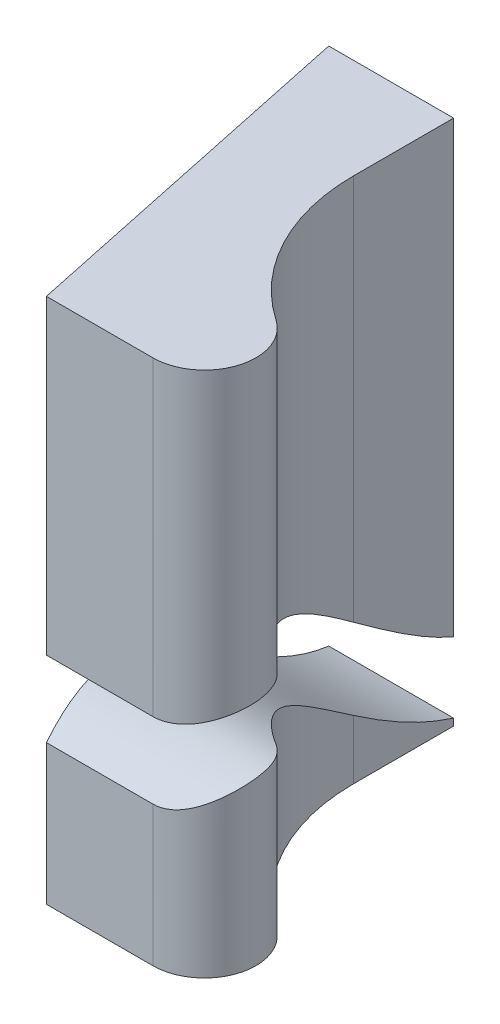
ISO-10303-21;
HEADER;
FILE_DESCRIPTION(('STEP AP214'),'2;1');
FILE_NAME('part.step','',(''),(''),'','','');
FILE_SCHEMA(('AUTOMOTIVE_DESIGN { 1 0 10303 214 1 1 1 1 }'));
ENDSEC;
DATA;
#1=APPLICATION_CONTEXT('core data for automotive mechanical design processes');
#2=APPLICATION_PROTOCOL_DEFINITION('international standard','automotive_design',2000,#1);
#3=PRODUCT_CONTEXT('',#1,'mechanical');
#4=PRODUCT('Part','Part','',(#3));
#5=PRODUCT_RELATED_PRODUCT_CATEGORY('part','',(#4));
#6=PRODUCT_DEFINITION_FORMATION('','',#4);
#7=PRODUCT_DEFINITION_CONTEXT('part definition',#1,'design');
#8=PRODUCT_DEFINITION('design','',#6,#7);
#9=PRODUCT_DEFINITION_SHAPE('','',#8);
#10=(LENGTH_UNIT() NAMED_UNIT(*) SI_UNIT(.MILLI.,.METRE.));
#11=(NAMED_UNIT(*) PLANE_ANGLE_UNIT() SI_UNIT($,.RADIAN.));
#12=(NAMED_UNIT(*) SI_UNIT($,.STERADIAN.) SOLID_ANGLE_UNIT());
#13=UNCERTAINTY_MEASURE_WITH_UNIT(LENGTH_MEASURE(1.E-05),#10,'distance_accuracy_value','');
#14=(GEOMETRIC_REPRESENTATION_CONTEXT(3) GLOBAL_UNCERTAINTY_ASSIGNED_CONTEXT((#13)) GLOBAL_UNIT_ASSIGNED_CONTEXT((#10,
#11,#12)) REPRESENTATION_CONTEXT('',''));
#15=CARTESIAN_POINT('',(0.,0.,0.));
#16=DIRECTION('',(0.,0.,1.));
#17=DIRECTION('',(1.,0.,0.));
#18=AXIS2_PLACEMENT_3D('',#15,#16,#17);
#19=CARTESIAN_POINT('',(6.68799385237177,101.6,-39.379349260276));
#20=DIRECTION('',(0.,0.,1.));
#21=DIRECTION('',(1.,0.,0.));
#22=AXIS2_PLACEMENT_3D('',#19,#20,#21);
#23=PLANE('',#22);
#24=DIRECTION('',(0.,-1.,0.));
#25=VECTOR('',#24,1.);
#26=CARTESIAN_POINT('',(-17.4066623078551,101.6,-39.379349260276));
#27=LINE('',#26,#25);
#28=CARTESIAN_POINT('',(-17.4066623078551,1.32705179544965,-39.379349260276));
#29=VERTEX_POINT('',#28);
#30=CARTESIAN_POINT('',(-17.4066623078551,0.,-39.379349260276));
#31=VERTEX_POINT('',#30);
#32=EDGE_CURVE('E114',#29,#31,#27,.T.);
#33=ORIENTED_EDGE('',*,*,#32,.F.);
#34=DIRECTION('',(1.,0.,0.));
#35=VECTOR('',#34,1.);
#36=CARTESIAN_POINT('',(4.59182488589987,1.32705179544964,-39.379349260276));
#37=LINE('',#36,#35);
#38=CARTESIAN_POINT('',(6.68799385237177,1.32705179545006,-39.3793492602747));
#39=VERTEX_POINT('',#38);
#40=EDGE_CURVE('E71',#29,#39,#37,.T.);
#41=ORIENTED_EDGE('',*,*,#40,.T.);
#42=DIRECTION('',(0.,-1.,0.));
#43=VECTOR('',#42,1.);
#44=CARTESIAN_POINT('',(6.68799385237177,101.6,-39.379349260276));
#45=LINE('',#44,#43);
#46=CARTESIAN_POINT('',(6.68799385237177,0.,-39.379349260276));
#47=VERTEX_POINT('',#46);
#48=EDGE_CURVE('E133',#39,#47,#45,.T.);
#49=ORIENTED_EDGE('',*,*,#48,.T.);
#50=DIRECTION('',(-1.,0.,0.));
#51=VECTOR('',#50,1.);
#52=CARTESIAN_POINT('',(6.68799385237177,0.,-39.379349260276));
#53=LINE('',#52,#51);
#54=EDGE_CURVE('E127',#47,#31,#53,.T.);
#55=ORIENTED_EDGE('',*,*,#54,.T.);
#56=EDGE_LOOP('',(#33,#41,#49,#55));
#57=FACE_BOUND('',#56,.T.);
#58=ADVANCED_FACE('F50',(#57),#23,.F.);
#59=CARTESIAN_POINT('',(-17.4066623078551,101.6,-39.379349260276));
#60=DIRECTION('',(0.97840332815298,0.,-0.206704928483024));
#61=DIRECTION('',(-0.206704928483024,0.,-0.97840332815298));
#62=AXIS2_PLACEMENT_3D('',#59,#60,#61);
#63=PLANE('',#62);
#64=DIRECTION('',(0.,-1.,0.));
#65=VECTOR('',#64,1.);
#66=CARTESIAN_POINT('',(-2.81317454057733,101.6,29.6964928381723));
#67=LINE('',#66,#65);
#68=CARTESIAN_POINT('',(-2.81317454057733,27.0247550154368,29.6964928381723));
#69=VERTEX_POINT('',#68);
#70=CARTESIAN_POINT('',(-2.81317454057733,0.,29.6964928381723));
#71=VERTEX_POINT('',#70);
#72=EDGE_CURVE('E109',#69,#71,#67,.T.);
#73=ORIENTED_EDGE('',*,*,#72,.F.);
#74=CARTESIAN_POINT('',(-2.81317454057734,27.0247550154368,29.6964928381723));
#75=CARTESIAN_POINT('',(-2.86577040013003,27.2133397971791,29.4475391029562));
#76=CARTESIAN_POINT('',(-2.91901082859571,27.3977581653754,29.1955344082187));
#77=CARTESIAN_POINT('',(-3.02687731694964,27.7578038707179,28.6849663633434));
#78=CARTESIAN_POINT('',(-3.08150554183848,27.9334160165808,28.4263927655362));
#79=CARTESIAN_POINT('',(-3.19211366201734,28.2748955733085,27.9028476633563));
#80=CARTESIAN_POINT('',(-3.24809462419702,28.4407549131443,27.6378711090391));
#81=CARTESIAN_POINT('',(-3.36136592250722,28.7618027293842,27.1017202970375));
#82=CARTESIAN_POINT('',(-3.41865651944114,28.9169890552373,26.8305448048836));
#83=CARTESIAN_POINT('',(-3.53462796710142,29.2161457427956,26.2816132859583));
#84=CARTESIAN_POINT('',(-3.59331141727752,29.3600925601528,26.0038449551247));
#85=CARTESIAN_POINT('',(-3.71188550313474,29.6355508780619,25.4425942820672));
#86=CARTESIAN_POINT('',(-3.77177565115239,29.7670672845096,25.159114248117));
#87=CARTESIAN_POINT('',(-3.89269970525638,30.0169103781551,24.5867403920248));
#88=CARTESIAN_POINT('',(-3.95373323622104,30.1352413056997,24.2978483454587));
#89=CARTESIAN_POINT('',(-4.07686955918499,30.35804083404,23.7150030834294));
#90=CARTESIAN_POINT('',(-4.13897232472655,30.4625097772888,23.4210499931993));
#91=CARTESIAN_POINT('',(-4.28585107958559,30.6906847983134,22.7258238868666));
#92=CARTESIAN_POINT('',(-4.37102199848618,30.8085003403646,22.3226815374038));
#93=CARTESIAN_POINT('',(-4.54280534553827,31.0166932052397,21.5095736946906));
#94=CARTESIAN_POINT('',(-4.6294181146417,31.1070639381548,21.099606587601));
#95=CARTESIAN_POINT('',(-4.80368942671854,31.2596779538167,20.2747223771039));
#96=CARTESIAN_POINT('',(-4.8913478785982,31.3219236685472,19.8598057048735));
#97=CARTESIAN_POINT('',(-5.06699950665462,31.4180500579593,19.0283879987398));
#98=CARTESIAN_POINT('',(-5.15499028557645,31.4520336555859,18.6118983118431));
#99=CARTESIAN_POINT('',(-5.33124373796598,31.4925266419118,17.7776319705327));
#100=CARTESIAN_POINT('',(-5.41950642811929,31.4990343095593,17.3598552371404));
#101=CARTESIAN_POINT('',(-5.59593939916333,31.4855967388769,16.5247391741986));
#102=CARTESIAN_POINT('',(-5.68410967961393,31.4656513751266,16.1073998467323));
#103=CARTESIAN_POINT('',(-5.87355613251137,31.3957532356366,15.2106866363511));
#104=CARTESIAN_POINT('',(-5.97476704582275,31.3416650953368,14.7316216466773));
#105=CARTESIAN_POINT('',(-6.17629545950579,31.2028406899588,13.7777204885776));
#106=CARTESIAN_POINT('',(-6.27661275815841,31.1180976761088,13.3028852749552));
#107=CARTESIAN_POINT('',(-6.4760748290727,30.9208789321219,12.3587648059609));
#108=CARTESIAN_POINT('',(-6.57521949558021,30.8084007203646,11.8894800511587));
#109=CARTESIAN_POINT('',(-6.77260954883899,30.5581030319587,10.9551671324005));
#110=CARTESIAN_POINT('',(-6.87084870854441,30.4201694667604,10.4901684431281));
#111=CARTESIAN_POINT('',(-7.06585574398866,30.1222306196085,9.56713514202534));
#112=CARTESIAN_POINT('',(-7.162623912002,29.9622297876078,9.10909914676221));
#113=CARTESIAN_POINT('',(-7.35466498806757,29.6228661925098,8.20010472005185));
#114=CARTESIAN_POINT('',(-7.4499382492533,29.4435080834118,7.74914461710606));
#115=CARTESIAN_POINT('',(-7.63504118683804,29.0757858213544,6.87299071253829));
#116=CARTESIAN_POINT('',(-7.72493069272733,28.8881232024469,6.44751371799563));
#117=CARTESIAN_POINT('',(-7.90344503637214,28.4991597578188,5.60254582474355));
#118=CARTESIAN_POINT('',(-7.99206976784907,28.2978577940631,5.18305542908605));
#119=CARTESIAN_POINT('',(-8.16818669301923,27.8831876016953,4.34943531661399));
#120=CARTESIAN_POINT('',(-8.25567794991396,27.6698100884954,3.93531003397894));
#121=CARTESIAN_POINT('',(-8.4295456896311,27.2326489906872,3.11233606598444));
#122=CARTESIAN_POINT('',(-8.51592211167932,27.008864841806,2.70348766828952));
#123=CARTESIAN_POINT('',(-8.68780040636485,26.5518473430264,1.88993040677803));
#124=CARTESIAN_POINT('',(-8.77330042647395,26.318597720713,1.48523031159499));
#125=CARTESIAN_POINT('',(-8.94336358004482,25.8442256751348,0.680264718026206));
#126=CARTESIAN_POINT('',(-9.02792668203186,25.6031029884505,0.279999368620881));
#127=CARTESIAN_POINT('',(-9.2805653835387,24.8689535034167,-0.915823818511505));
#128=CARTESIAN_POINT('',(-9.44737501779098,24.3657247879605,-1.70538942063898));
#129=CARTESIAN_POINT('',(-9.77832512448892,23.3395542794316,-3.27188659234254));
#130=CARTESIAN_POINT('',(-9.94246599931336,22.8166154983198,-4.04882006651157));
#131=CARTESIAN_POINT('',(-10.2699464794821,21.753186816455,-5.59889433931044));
#132=CARTESIAN_POINT('',(-10.4332726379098,21.2126003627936,-6.37197148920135));
#133=CARTESIAN_POINT('',(-10.758392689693,20.1232699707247,-7.9108730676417));
#134=CARTESIAN_POINT('',(-10.9201885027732,19.5745393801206,-8.67670658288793));
#135=CARTESIAN_POINT('',(-11.2429955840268,18.4729530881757,-10.204660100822));
#136=CARTESIAN_POINT('',(-11.4040073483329,17.9201007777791,-10.9667824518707));
#137=CARTESIAN_POINT('',(-11.7259327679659,16.8138968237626,-12.4905627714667));
#138=CARTESIAN_POINT('',(-11.8868464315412,16.2605452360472,-13.2522207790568));
#139=CARTESIAN_POINT('',(-12.2092270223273,15.1567254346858,-14.7781555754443));
#140=CARTESIAN_POINT('',(-12.3706941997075,14.6062589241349,-15.542433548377));
#141=CARTESIAN_POINT('',(-12.659136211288,13.6320124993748,-16.9077257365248));
#142=CARTESIAN_POINT('',(-12.7859180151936,13.2068977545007,-17.5078262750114));
#143=CARTESIAN_POINT('',(-13.0403744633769,12.3624345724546,-18.7122534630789));
#144=CARTESIAN_POINT('',(-13.1680494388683,11.9430884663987,-19.3165816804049));
#145=CARTESIAN_POINT('',(-13.4244653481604,11.1121800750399,-20.5302836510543));
#146=CARTESIAN_POINT('',(-13.5532062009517,10.7006172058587,-21.139657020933));
#147=CARTESIAN_POINT('',(-13.8119309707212,9.88732216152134,-22.3642875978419));
#148=CARTESIAN_POINT('',(-13.9419143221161,9.48558578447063,-22.979542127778));
#149=CARTESIAN_POINT('',(-14.2033076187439,8.69403789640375,-24.2168037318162));
#150=CARTESIAN_POINT('',(-14.3347165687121,8.30421871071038,-24.8388060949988));
#151=CARTESIAN_POINT('',(-14.5991535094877,7.53866547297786,-26.090474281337));
#152=CARTESIAN_POINT('',(-14.7321802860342,7.16292162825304,-26.7201343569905));
#153=CARTESIAN_POINT('',(-15.0003728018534,6.42689955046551,-27.9895789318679));
#154=CARTESIAN_POINT('',(-15.1355419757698,6.06665053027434,-28.6293796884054));
#155=CARTESIAN_POINT('',(-15.4079385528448,5.36492059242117,-29.9187234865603));
#156=CARTESIAN_POINT('',(-15.5451657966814,5.02343823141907,-30.5682657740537));
#157=CARTESIAN_POINT('',(-15.8219079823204,4.36178140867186,-31.8781787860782));
#158=CARTESIAN_POINT('',(-15.9614242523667,4.04161990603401,-32.5385557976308));
#159=CARTESIAN_POINT('',(-16.2429889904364,3.42532273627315,-33.8712955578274));
#160=CARTESIAN_POINT('',(-16.3850412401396,3.12922738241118,-34.5436762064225));
#161=CARTESIAN_POINT('',(-16.6719487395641,2.56398368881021,-35.9017050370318));
#162=CARTESIAN_POINT('',(-16.8168113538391,2.2949223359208,-36.5873880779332));
#163=CARTESIAN_POINT('',(-17.1096114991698,1.78694056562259,-37.973308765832));
#164=CARTESIAN_POINT('',(-17.2575609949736,1.54818190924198,-38.6736030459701));
#165=CARTESIAN_POINT('',(-17.4066623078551,1.32705179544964,-39.379349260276));
#166=B_SPLINE_CURVE_WITH_KNOTS('',3,(#74,#75,#76,#77,#78,#79,#80,#81,#82,#83,#84,#85,#86,#87,
#88,#89,#90,#91,#92,#93,#94,#95,#96,#97,#98,#99,#100,#101,#102,#103,#104,#105,#106,#107,#108,
#109,#110,#111,#112,#113,#114,#115,#116,#117,#118,#119,#120,#121,#122,#123,#124,#125,#126,#127,
#128,#129,#130,#131,#132,#133,#134,#135,#136,#137,#138,#139,#140,#141,#142,#143,#144,#145,#146,
#147,#148,#149,#150,#151,#152,#153,#154,#155,#156,#157,#158,#159,#160,#161,#162,#163,#164,#165),
.UNSPECIFIED.,.F.,.F.,(4,2,2,2,2,2,2,2,2,2,2,2,2,2,2,2,2,2,2,2,2,2,2,2,2,2,2,2,2,2,2,2,2,2,2,2,
2,2,2,2,2,2,2,2,2,4),(0.,0.95013908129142,1.90186448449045,2.85436672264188,3.8070603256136,
4.76169886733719,5.71595905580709,6.66991147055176,7.62384031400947,8.90854631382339,
10.193560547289,11.4784636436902,12.7586667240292,14.0389499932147,15.3192393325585,
16.7960093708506,18.2731047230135,19.750332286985,21.2343489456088,22.7180667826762,
24.2014286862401,25.6220655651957,27.0428211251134,28.4646843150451,29.8866246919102,
31.3111227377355,32.7356684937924,35.5883345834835,38.4405665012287,41.3125748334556,
44.1803059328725,47.045892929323,49.9111912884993,52.7780243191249,55.0168052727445,
57.2564658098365,59.4959576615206,61.7344745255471,63.9715180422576,66.2069751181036,
68.4464769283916,70.6858062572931,72.9264844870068,75.1708418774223,77.4222039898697,
79.6851195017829),.UNSPECIFIED.);
#167=EDGE_CURVE('E119',#69,#29,#166,.T.);
#168=ORIENTED_EDGE('',*,*,#167,.T.);
#169=ORIENTED_EDGE('',*,*,#32,.T.);
#170=DIRECTION('',(0.206704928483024,0.,0.97840332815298));
#171=VECTOR('',#170,1.);
#172=CARTESIAN_POINT('',(-17.4066623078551,0.,-39.379349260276));
#173=LINE('',#172,#171);
#174=EDGE_CURVE('E117',#31,#71,#173,.T.);
#175=ORIENTED_EDGE('',*,*,#174,.T.);
#176=EDGE_LOOP('',(#73,#168,#169,#175));
#177=FACE_BOUND('',#176,.T.);
#178=ADVANCED_FACE('F116',(#177),#63,.F.);
#179=CARTESIAN_POINT('',(-2.81317454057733,101.6,29.6964928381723));
#180=DIRECTION('',(0.,0.,-1.));
#181=DIRECTION('',(-1.,0.,0.));
#182=AXIS2_PLACEMENT_3D('',#179,#180,#181);
#183=PLANE('',#182);
#184=DIRECTION('',(0.,-1.,0.));
#185=VECTOR('',#184,1.);
#186=CARTESIAN_POINT('',(17.7258082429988,101.6,29.6964928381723));
#187=LINE('',#186,#185);
#188=CARTESIAN_POINT('',(17.7258082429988,27.0247550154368,29.6964928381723));
#189=VERTEX_POINT('',#188);
#190=CARTESIAN_POINT('',(17.7258082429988,0.,29.6964928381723));
#191=VERTEX_POINT('',#190);
#192=EDGE_CURVE('E218',#189,#191,#187,.T.);
#193=ORIENTED_EDGE('',*,*,#192,.F.);
#194=DIRECTION('',(1.,0.,0.));
#195=VECTOR('',#194,1.);
#196=CARTESIAN_POINT('',(4.59182488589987,27.0247550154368,29.6964928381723));
#197=LINE('',#196,#195);
#198=EDGE_CURVE('E130',#189,#69,#197,.F.);
#199=ORIENTED_EDGE('',*,*,#198,.T.);
#200=ORIENTED_EDGE('',*,*,#72,.T.);
#201=DIRECTION('',(1.,0.,0.));
#202=VECTOR('',#201,1.);
#203=CARTESIAN_POINT('',(-2.81317454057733,0.,29.6964928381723));
#204=LINE('',#203,#202);
#205=EDGE_CURVE('E129',#71,#191,#204,.T.);
#206=ORIENTED_EDGE('',*,*,#205,.T.);
#207=EDGE_LOOP('',(#193,#199,#200,#206));
#208=FACE_BOUND('',#207,.T.);
#209=ADVANCED_FACE('F147',(#208),#183,.F.);
#210=CARTESIAN_POINT('',(17.7258082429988,101.6,19.7461535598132));
#211=DIRECTION('',(0.,-1.,0.));
#212=DIRECTION('',(0.,0.,-1.));
#213=AXIS2_PLACEMENT_3D('',#210,#211,#212);
#214=CYLINDRICAL_SURFACE('',#213,9.95033927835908);
#215=DIRECTION('',(0.,-1.,0.));
#216=VECTOR('',#215,1.);
#217=CARTESIAN_POINT('',(23.3470035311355,101.6,11.5357080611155));
#218=LINE('',#217,#216);
#219=CARTESIAN_POINT('',(23.3470035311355,30.7133704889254,11.5357080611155));
#220=VERTEX_POINT('',#219);
#221=CARTESIAN_POINT('',(23.3470035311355,0.,11.5357080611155));
#222=VERTEX_POINT('',#221);
#223=EDGE_CURVE('E224',#220,#222,#218,.T.);
#224=ORIENTED_EDGE('',*,*,#223,.F.);
#225=CARTESIAN_POINT('',(23.3470035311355,30.7133704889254,11.5357080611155));
#226=CARTESIAN_POINT('',(23.5765390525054,30.7547322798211,11.6928392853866));
#227=CARTESIAN_POINT('',(23.7993347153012,30.7971264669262,11.8595273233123));
#228=CARTESIAN_POINT('',(24.2301638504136,30.8824133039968,12.21091579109));
#229=CARTESIAN_POINT('',(24.43819626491,30.9253059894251,12.3956175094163));
#230=CARTESIAN_POINT('',(24.8387375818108,31.0101345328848,12.7824446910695));
#231=CARTESIAN_POINT('',(25.0312018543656,31.0520674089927,12.9846170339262));
#232=CARTESIAN_POINT('',(25.398713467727,31.1331717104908,13.4047296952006));
#233=CARTESIAN_POINT('',(25.5737613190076,31.1723432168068,13.6226695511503));
#234=CARTESIAN_POINT('',(25.9054902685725,31.2462644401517,14.0733703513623));
#235=CARTESIAN_POINT('',(26.062141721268,31.281007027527,14.3061543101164));
#236=CARTESIAN_POINT('',(26.3555475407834,31.3442528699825,14.7847403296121));
#237=CARTESIAN_POINT('',(26.4923033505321,31.3727565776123,15.0305414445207));
#238=CARTESIAN_POINT('',(26.7446029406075,31.4217923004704,15.5331334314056));
#239=CARTESIAN_POINT('',(26.8601769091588,31.4423357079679,15.7899080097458));
#240=CARTESIAN_POINT('',(27.0693036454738,31.4739268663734,16.3128425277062));
#241=CARTESIAN_POINT('',(27.1628579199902,31.4849752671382,16.5790018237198));
#242=CARTESIAN_POINT('',(27.3231037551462,31.4959320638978,17.1054747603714));
#243=CARTESIAN_POINT('',(27.3908751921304,31.4963531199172,17.3654490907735));
#244=CARTESIAN_POINT('',(27.5051401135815,31.4864211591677,17.8898353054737));
#245=CARTESIAN_POINT('',(27.5516343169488,31.4760685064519,18.1542470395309));
#246=CARTESIAN_POINT('',(27.6230562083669,31.4439791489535,18.6852582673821));
#247=CARTESIAN_POINT('',(27.6479859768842,31.4222435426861,18.9518575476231));
#248=CARTESIAN_POINT('',(27.676300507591,31.3671488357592,19.4849903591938));
#249=CARTESIAN_POINT('',(27.6796861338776,31.3337902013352,19.7515238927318));
#250=CARTESIAN_POINT('',(27.6657405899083,31.2583164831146,20.2639055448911));
#251=CARTESIAN_POINT('',(27.6498284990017,31.2169682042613,20.5099074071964));
#252=CARTESIAN_POINT('',(27.6001029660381,31.1247552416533,20.9982695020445));
#253=CARTESIAN_POINT('',(27.5662905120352,31.0738910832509,21.2406299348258));
#254=CARTESIAN_POINT('',(27.4813976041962,30.9632987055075,21.7202480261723));
#255=CARTESIAN_POINT('',(27.430316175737,30.9035699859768,21.9575053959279));
#256=CARTESIAN_POINT('',(27.3116266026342,30.7761025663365,22.4256419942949));
#257=CARTESIAN_POINT('',(27.2440176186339,30.7083634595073,22.6565208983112));
#258=CARTESIAN_POINT('',(27.0893976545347,30.5624152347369,23.1218674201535));
#259=CARTESIAN_POINT('',(27.0016042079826,30.4838575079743,23.3559652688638));
#260=CARTESIAN_POINT('',(26.8095855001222,30.3202711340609,23.8150838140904));
#261=CARTESIAN_POINT('',(26.7053532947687,30.2352397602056,24.0401006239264));
#262=CARTESIAN_POINT('',(26.4812978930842,30.0600480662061,24.48024898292));
#263=CARTESIAN_POINT('',(26.3614692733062,29.9698859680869,24.6953770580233));
#264=CARTESIAN_POINT('',(26.1070115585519,29.7858450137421,25.1150371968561));
#265=CARTESIAN_POINT('',(25.9723810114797,29.6919657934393,25.3195682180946));
#266=CARTESIAN_POINT('',(25.668401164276,29.4881053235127,25.746380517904));
#267=CARTESIAN_POINT('',(25.4968492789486,29.3777657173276,25.9669255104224));
#268=CARTESIAN_POINT('',(25.1360485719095,29.1562505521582,26.3926153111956));
#269=CARTESIAN_POINT('',(24.9467975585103,29.0450748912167,26.5977582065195));
#270=CARTESIAN_POINT('',(24.5512124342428,28.8240837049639,26.9919187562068));
#271=CARTESIAN_POINT('',(24.3448691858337,28.7142689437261,27.1809276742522));
#272=CARTESIAN_POINT('',(23.9158369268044,28.4984110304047,27.5417514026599));
#273=CARTESIAN_POINT('',(23.693149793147,28.3923674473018,27.7135681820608));
#274=CARTESIAN_POINT('',(23.2541153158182,28.196344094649,28.0233625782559));
#275=CARTESIAN_POINT('',(23.0391954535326,28.1057976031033,28.1630048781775));
#276=CARTESIAN_POINT('',(22.5971144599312,27.931710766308,28.4263495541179));
#277=CARTESIAN_POINT('',(22.3699553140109,27.8481692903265,28.5500545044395));
#278=CARTESIAN_POINT('',(21.904775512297,27.6902689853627,28.7801241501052));
#279=CARTESIAN_POINT('',(21.6667862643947,27.6158856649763,28.8865353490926));
#280=CARTESIAN_POINT('',(21.1804279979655,27.4780168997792,29.0812187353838));
#281=CARTESIAN_POINT('',(20.9320596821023,27.4145307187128,29.1694921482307));
#282=CARTESIAN_POINT('',(20.4451176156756,27.3045901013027,29.3208443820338));
#283=CARTESIAN_POINT('',(20.2071807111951,27.2572225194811,29.3853049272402));
#284=CARTESIAN_POINT('',(19.725182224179,27.1748274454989,29.4966880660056));
#285=CARTESIAN_POINT('',(19.4811220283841,27.1397971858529,29.5436145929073));
#286=CARTESIAN_POINT('',(18.986458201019,27.0829164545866,29.6195078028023));
#287=CARTESIAN_POINT('',(18.7358162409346,27.0611825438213,29.6483157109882));
#288=CARTESIAN_POINT('',(18.3580945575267,27.0393677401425,29.6771888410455));
#289=CARTESIAN_POINT('',(18.2318192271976,27.0338937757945,29.6844234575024));
#290=CARTESIAN_POINT('',(17.9789719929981,27.0265857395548,29.6940763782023));
#291=CARTESIAN_POINT('',(17.8524000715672,27.0247518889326,29.6964943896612));
#292=CARTESIAN_POINT('',(17.7258082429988,27.0247550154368,29.6964928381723));
#293=B_SPLINE_CURVE_WITH_KNOTS('',3,(#225,#226,#227,#228,#229,#230,#231,#232,#233,#234,#235,
#236,#237,#238,#239,#240,#241,#242,#243,#244,#245,#246,#247,#248,#249,#250,#251,#252,#253,#254,
#255,#256,#257,#258,#259,#260,#261,#262,#263,#264,#265,#266,#267,#268,#269,#270,#271,#272,#273,
#274,#275,#276,#277,#278,#279,#280,#281,#282,#283,#284,#285,#286,#287,#288,#289,#290,#291,#292),
.UNSPECIFIED.,.F.,.F.,(4,2,2,2,2,2,2,2,2,2,2,2,2,2,2,2,2,2,2,2,2,2,2,2,2,2,2,2,2,2,2,2,2,4),(0.,
0.843420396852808,1.68690116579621,2.53272007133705,3.37851417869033,4.22565309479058,
5.07273054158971,5.91859118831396,6.76439393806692,7.56931313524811,8.37420513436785,
9.17901947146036,9.98380152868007,10.732825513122,11.4818081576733,12.230833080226,
12.9798960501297,13.7653179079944,14.5510724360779,15.337100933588,16.1232066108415,
17.0234829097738,17.9238708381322,18.824743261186,19.725512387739,20.540209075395,
21.3547740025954,22.1671109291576,22.9793929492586,23.7315185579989,24.4834753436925,
25.2419329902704,25.6216098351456,26.0013097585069),.UNSPECIFIED.);
#294=EDGE_CURVE('E87',#220,#189,#293,.T.);
#295=ORIENTED_EDGE('',*,*,#294,.T.);
#296=ORIENTED_EDGE('',*,*,#192,.T.);
#297=CARTESIAN_POINT('',(17.7258082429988,0.,19.7461535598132));
#298=DIRECTION('',(0.,1.,0.));
#299=DIRECTION('',(0.,0.,1.));
#300=AXIS2_PLACEMENT_3D('',#297,#298,#299);
#301=CIRCLE('',#300,9.95033927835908);
#302=EDGE_CURVE('E223',#191,#222,#301,.T.);
#303=ORIENTED_EDGE('',*,*,#302,.T.);
#304=EDGE_LOOP('',(#224,#295,#296,#303));
#305=FACE_BOUND('',#304,.T.);
#306=ADVANCED_FACE('F165',(#305),#214,.T.);
#307=CARTESIAN_POINT('',(44.9779649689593,101.6,-20.0589654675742));
#308=DIRECTION('',(0.,-1.,0.));
#309=DIRECTION('',(0.,0.,-1.));
#310=AXIS2_PLACEMENT_3D('',#307,#308,#309);
#311=CYLINDRICAL_SURFACE('',#310,38.2899711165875);
#312=DIRECTION('',(0.,-1.,0.));
#313=VECTOR('',#312,1.);
#314=CARTESIAN_POINT('',(6.68799385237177,101.6,-20.0589654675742));
#315=LINE('',#314,#313);
#316=CARTESIAN_POINT('',(6.68799385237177,11.4349415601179,-20.0589654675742));
#317=VERTEX_POINT('',#316);
#318=CARTESIAN_POINT('',(6.68799385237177,0.,-20.0589654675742));
#319=VERTEX_POINT('',#318);
#320=EDGE_CURVE('E63',#317,#319,#315,.T.);
#321=ORIENTED_EDGE('',*,*,#320,.F.);
#322=CARTESIAN_POINT('',(6.68799385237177,11.4349415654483,-20.0589654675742));
#323=CARTESIAN_POINT('',(6.68799724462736,11.6618463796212,-19.7268533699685));
#324=CARTESIAN_POINT('',(6.69231444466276,11.8899067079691,-19.3955511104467));
#325=CARTESIAN_POINT('',(6.70947825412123,12.3479507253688,-18.7345106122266));
#326=CARTESIAN_POINT('',(6.72232467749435,12.5779343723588,-18.4047723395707));
#327=CARTESIAN_POINT('',(6.77356075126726,13.2708797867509,-17.4168345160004));
#328=CARTESIAN_POINT('',(6.82464665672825,13.736169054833,-16.7608845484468));
#329=CARTESIAN_POINT('',(6.96023220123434,14.6702383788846,-15.4539754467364));
#330=CARTESIAN_POINT('',(7.04476597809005,15.1390215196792,-14.8030221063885));
#331=CARTESIAN_POINT('',(7.24719065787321,16.0767503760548,-13.5059843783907));
#332=CARTESIAN_POINT('',(7.36509637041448,16.5456960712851,-12.859902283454));
#333=CARTESIAN_POINT('',(7.63713846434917,17.489537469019,-11.5598979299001));
#334=CARTESIAN_POINT('',(7.79193679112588,17.9643707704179,-10.9060686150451));
#335=CARTESIAN_POINT('',(8.13704750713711,18.9071514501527,-9.60321953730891));
#336=CARTESIAN_POINT('',(8.32734569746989,19.3751015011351,-8.95419795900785));
#337=CARTESIAN_POINT('',(8.74438808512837,20.3004729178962,-7.66093519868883));
#338=CARTESIAN_POINT('',(8.97111166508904,20.7579000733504,-7.01669152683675));
#339=CARTESIAN_POINT('',(9.46232774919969,21.6585700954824,-5.7329931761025));
#340=CARTESIAN_POINT('',(9.72680600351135,22.1018182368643,-5.09353678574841));
#341=CARTESIAN_POINT('',(10.1847413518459,22.8015651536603,-4.0672390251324));
#342=CARTESIAN_POINT('',(10.365889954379,23.0637368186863,-3.67873846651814));
#343=CARTESIAN_POINT('',(10.7432878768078,23.5803430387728,-2.90395314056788));
#344=CARTESIAN_POINT('',(10.9395361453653,23.8347781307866,-2.51766822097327));
#345=CARTESIAN_POINT('',(11.3475054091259,24.334910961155,-1.7476603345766));
#346=CARTESIAN_POINT('',(11.5592252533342,24.5806093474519,-1.36393717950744));
#347=CARTESIAN_POINT('',(11.9985430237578,25.062305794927,-0.599417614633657));
#348=CARTESIAN_POINT('',(12.2261426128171,25.2983028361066,-0.218621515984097));
#349=CARTESIAN_POINT('',(12.6953371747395,25.7574070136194,0.535921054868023));
#350=CARTESIAN_POINT('',(12.9367820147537,25.9806137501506,0.909700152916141));
#351=CARTESIAN_POINT('',(13.4358551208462,26.4155385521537,1.65318929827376));
#352=CARTESIAN_POINT('',(13.6934847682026,26.6272556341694,2.02289899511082));
#353=CARTESIAN_POINT('',(14.2250714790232,27.0382356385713,2.75740854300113));
#354=CARTESIAN_POINT('',(14.4990267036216,27.2374999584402,3.12220894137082));
#355=CARTESIAN_POINT('',(15.0633597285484,27.6227376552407,3.84603065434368));
#356=CARTESIAN_POINT('',(15.3537358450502,27.8087123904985,4.2050525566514));
#357=CARTESIAN_POINT('',(15.9199881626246,28.1481290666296,4.87954255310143));
#358=CARTESIAN_POINT('',(16.1942536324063,28.302945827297,5.19567193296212));
#359=CARTESIAN_POINT('',(16.7558713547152,28.6009057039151,5.82176409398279));
#360=CARTESIAN_POINT('',(17.0432237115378,28.7440487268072,6.1317268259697));
#361=CARTESIAN_POINT('',(17.6307929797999,29.0183424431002,6.74465910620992));
#362=CARTESIAN_POINT('',(17.9310092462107,29.1494937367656,7.04762900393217));
#363=CARTESIAN_POINT('',(18.5440139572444,29.3996358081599,7.64575428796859));
#364=CARTESIAN_POINT('',(18.8568020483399,29.5186269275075,7.94090989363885));
#365=CARTESIAN_POINT('',(19.4994578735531,29.7461572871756,8.52703771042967));
#366=CARTESIAN_POINT('',(19.8295138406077,29.8545085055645,8.81787658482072));
#367=CARTESIAN_POINT('',(20.5017393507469,30.0588048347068,9.3898215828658));
#368=CARTESIAN_POINT('',(20.8439101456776,30.1547486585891,9.67092669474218));
#369=CARTESIAN_POINT('',(21.5398604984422,30.3345382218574,10.2226180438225));
#370=CARTESIAN_POINT('',(21.893642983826,30.4183808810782,10.4932015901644));
#371=CARTESIAN_POINT('',(22.6122360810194,30.5744652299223,11.0231146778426));
#372=CARTESIAN_POINT('',(22.9770506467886,30.6467027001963,11.2824401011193));
#373=CARTESIAN_POINT('',(23.3470035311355,30.7133704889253,11.5357080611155));
#374=B_SPLINE_CURVE_WITH_KNOTS('',3,(#322,#323,#324,#325,#326,#327,#328,#329,#330,#331,#332,
#333,#334,#335,#336,#337,#338,#339,#340,#341,#342,#343,#344,#345,#346,#347,#348,#349,#350,#351,
#352,#353,#354,#355,#356,#357,#358,#359,#360,#361,#362,#363,#364,#365,#366,#367,#368,#369,#370,
#371,#372,#373),.UNSPECIFIED.,.F.,.F.,(4,2,2,2,2,2,2,2,2,2,2,2,2,2,2,2,2,2,2,2,2,2,2,2,2,4),(0.,
1.2066157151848,2.41320511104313,4.82991878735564,7.24910541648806,9.66936730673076,
12.1368458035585,14.6033394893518,17.0684419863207,19.532616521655,21.0397907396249,
22.5468601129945,24.05381748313,25.5609328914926,27.054008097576,28.5472109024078,
30.0402458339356,31.5331279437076,32.8714675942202,34.2098179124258,35.5481012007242,
36.8863468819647,38.245091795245,39.6039775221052,40.9632085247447,42.3229325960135),.UNSPECIFIED.);
#375=EDGE_CURVE('E90',#317,#220,#374,.T.);
#376=ORIENTED_EDGE('',*,*,#375,.T.);
#377=ORIENTED_EDGE('',*,*,#223,.T.);
#378=CARTESIAN_POINT('',(44.9779649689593,0.,-20.0589654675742));
#379=DIRECTION('',(0.,-1.,0.));
#380=DIRECTION('',(0.,0.,-1.));
#381=AXIS2_PLACEMENT_3D('',#378,#379,#380);
#382=CIRCLE('',#381,38.2899711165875);
#383=EDGE_CURVE('E226',#222,#319,#382,.T.);
#384=ORIENTED_EDGE('',*,*,#383,.T.);
#385=EDGE_LOOP('',(#321,#376,#377,#384));
#386=FACE_BOUND('',#385,.T.);
#387=ADVANCED_FACE('F171',(#386),#311,.F.);
#388=CARTESIAN_POINT('',(6.68799385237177,101.6,-20.0589654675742));
#389=DIRECTION('',(-1.,0.,0.));
#390=DIRECTION('',(0.,0.,1.));
#391=AXIS2_PLACEMENT_3D('',#388,#389,#390);
#392=PLANE('',#391);
#393=ORIENTED_EDGE('',*,*,#48,.F.);
#394=CARTESIAN_POINT('',(6.68799385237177,-4.61815557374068,50.2563988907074));
#395=CARTESIAN_POINT('',(6.68799385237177,81.4124609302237,13.8907957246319));
#396=CARTESIAN_POINT('',(6.68799385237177,-15.5554107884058,-14.6119008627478));
#397=CARTESIAN_POINT('',(6.68799385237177,1.62993726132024,-62.2092721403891));
#398=B_SPLINE_CURVE_WITH_KNOTS('',3,(#394,#395,#396,#397),.UNSPECIFIED.,.F.,.F.,(4,4),(0.,1.),.UNSPECIFIED.);
#399=EDGE_CURVE('E227',#39,#317,#398,.F.);
#400=ORIENTED_EDGE('',*,*,#399,.T.);
#401=ORIENTED_EDGE('',*,*,#320,.T.);
#402=DIRECTION('',(0.,0.,-1.));
#403=VECTOR('',#402,1.);
#404=CARTESIAN_POINT('',(6.68799385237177,0.,-20.0589654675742));
#405=LINE('',#404,#403);
#406=EDGE_CURVE('E12',#319,#47,#405,.T.);
#407=ORIENTED_EDGE('',*,*,#406,.T.);
#408=EDGE_LOOP('',(#393,#400,#401,#407));
#409=FACE_BOUND('',#408,.T.);
#410=ADVANCED_FACE('F178',(#409),#392,.F.);
#411=CARTESIAN_POINT('',(17.7258082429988,0.,19.7461535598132));
#412=DIRECTION('',(0.,1.,0.));
#413=DIRECTION('',(0.,0.,1.));
#414=AXIS2_PLACEMENT_3D('',#411,#412,#413);
#415=PLANE('',#414);
#416=ORIENTED_EDGE('',*,*,#54,.F.);
#417=ORIENTED_EDGE('',*,*,#406,.F.);
#418=ORIENTED_EDGE('',*,*,#383,.F.);
#419=ORIENTED_EDGE('',*,*,#302,.F.);
#420=ORIENTED_EDGE('',*,*,#205,.F.);
#421=ORIENTED_EDGE('',*,*,#174,.F.);
#422=EDGE_LOOP('',(#416,#417,#418,#419,#420,#421));
#423=FACE_BOUND('',#422,.T.);
#424=ADVANCED_FACE('F125',(#423),#415,.F.);
#425=CARTESIAN_POINT('',(-50.8,-4.61815557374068,50.2563988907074));
#426=CARTESIAN_POINT('',(-50.8,81.4124609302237,13.8907957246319));
#427=CARTESIAN_POINT('',(-50.8,-15.5554107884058,-14.6119008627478));
#428=CARTESIAN_POINT('',(-50.8,1.62993726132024,-62.2092721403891));
#429=B_SPLINE_CURVE_WITH_KNOTS('',3,(#425,#426,#427,#428),.UNSPECIFIED.,.F.,.F.,(4,4),(0.,1.),.UNSPECIFIED.);
#430=DIRECTION('',(1.,0.,0.));
#431=VECTOR('',#430,1.);
#432=SURFACE_OF_LINEAR_EXTRUSION('',#429,#431);
#433=ORIENTED_EDGE('',*,*,#167,.F.);
#434=ORIENTED_EDGE('',*,*,#198,.F.);
#435=ORIENTED_EDGE('',*,*,#294,.F.);
#436=ORIENTED_EDGE('',*,*,#375,.F.);
#437=ORIENTED_EDGE('',*,*,#399,.F.);
#438=ORIENTED_EDGE('',*,*,#40,.F.);
#439=EDGE_LOOP('',(#433,#434,#435,#436,#437,#438));
#440=FACE_BOUND('',#439,.T.);
#441=ADVANCED_FACE('F52',(#440),#432,.F.);
#442=CLOSED_SHELL('',(#58,#178,#209,#306,#387,#410,#424,#441));
#443=MANIFOLD_SOLID_BREP('B2',#442);
#444=CARTESIAN_POINT('',(17.7258082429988,101.6,19.7461535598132));
#445=DIRECTION('',(0.,1.,0.));
#446=DIRECTION('',(0.,0.,1.));
#447=AXIS2_PLACEMENT_3D('',#444,#445,#446);
#448=PLANE('',#447);
#449=DIRECTION('',(-1.,0.,0.));
#450=VECTOR('',#449,1.);
#451=CARTESIAN_POINT('',(6.68799385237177,101.6,-39.379349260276));
#452=LINE('',#451,#450);
#453=CARTESIAN_POINT('',(6.68799385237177,101.6,-39.379349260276));
#454=VERTEX_POINT('',#453);
#455=CARTESIAN_POINT('',(-17.4066623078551,101.6,-39.379349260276));
#456=VERTEX_POINT('',#455);
#457=EDGE_CURVE('E361',#454,#456,#452,.T.);
#458=ORIENTED_EDGE('',*,*,#457,.T.);
#459=DIRECTION('',(0.206704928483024,0.,0.97840332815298));
#460=VECTOR('',#459,1.);
#461=CARTESIAN_POINT('',(-17.4066623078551,101.6,-39.379349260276));
#462=LINE('',#461,#460);
#463=CARTESIAN_POINT('',(-2.81317454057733,101.6,29.6964928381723));
#464=VERTEX_POINT('',#463);
#465=EDGE_CURVE('E358',#456,#464,#462,.T.);
#466=ORIENTED_EDGE('',*,*,#465,.T.);
#467=DIRECTION('',(1.,0.,0.));
#468=VECTOR('',#467,1.);
#469=CARTESIAN_POINT('',(-2.81317454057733,101.6,29.6964928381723));
#470=LINE('',#469,#468);
#471=CARTESIAN_POINT('',(17.7258082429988,101.6,29.6964928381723));
#472=VERTEX_POINT('',#471);
#473=EDGE_CURVE('E372',#464,#472,#470,.T.);
#474=ORIENTED_EDGE('',*,*,#473,.T.);
#475=CARTESIAN_POINT('',(17.7258082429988,101.6,19.7461535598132));
#476=DIRECTION('',(0.,1.,0.));
#477=DIRECTION('',(0.,0.,1.));
#478=AXIS2_PLACEMENT_3D('',#475,#476,#477);
#479=CIRCLE('',#478,9.95033927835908);
#480=CARTESIAN_POINT('',(23.3470035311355,101.6,11.5357080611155));
#481=VERTEX_POINT('',#480);
#482=EDGE_CURVE('E374',#472,#481,#479,.T.);
#483=ORIENTED_EDGE('',*,*,#482,.T.);
#484=CARTESIAN_POINT('',(44.9779649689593,101.6,-20.0589654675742));
#485=DIRECTION('',(0.,-1.,0.));
#486=DIRECTION('',(0.,0.,-1.));
#487=AXIS2_PLACEMENT_3D('',#484,#485,#486);
#488=CIRCLE('',#487,38.2899711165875);
#489=CARTESIAN_POINT('',(6.68799385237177,101.6,-20.0589654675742));
#490=VERTEX_POINT('',#489);
#491=EDGE_CURVE('E376',#481,#490,#488,.T.);
#492=ORIENTED_EDGE('',*,*,#491,.T.);
#493=DIRECTION('',(0.,0.,-1.));
#494=VECTOR('',#493,1.);
#495=CARTESIAN_POINT('',(6.68799385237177,101.6,-20.0589654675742));
#496=LINE('',#495,#494);
#497=EDGE_CURVE('E294',#490,#454,#496,.T.);
#498=ORIENTED_EDGE('',*,*,#497,.T.);
#499=EDGE_LOOP('',(#458,#466,#474,#483,#492,#498));
#500=FACE_BOUND('',#499,.T.);
#501=ADVANCED_FACE('F267',(#500),#448,.T.);
#502=CARTESIAN_POINT('',(6.68799385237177,101.6,-20.0589654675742));
#503=DIRECTION('',(-1.,0.,0.));
#504=DIRECTION('',(0.,0.,1.));
#505=AXIS2_PLACEMENT_3D('',#502,#503,#504);
#506=PLANE('',#505);
#507=CARTESIAN_POINT('',(6.68799385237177,14.8806092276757,-39.379349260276));
#508=CARTESIAN_POINT('',(6.68799385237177,15.0085762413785,-39.0872234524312));
#509=CARTESIAN_POINT('',(6.68799385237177,15.1397040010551,-38.796500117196));
#510=CARTESIAN_POINT('',(6.68799385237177,15.4077752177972,-38.217770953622));
#511=CARTESIAN_POINT('',(6.68799385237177,15.5447182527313,-37.9297649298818));
#512=CARTESIAN_POINT('',(6.68799385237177,15.962696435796,-37.0713614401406));
#513=CARTESIAN_POINT('',(6.68799385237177,16.2516601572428,-36.5048143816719));
#514=CARTESIAN_POINT('',(6.68799385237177,16.8468561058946,-35.3820839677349));
#515=CARTESIAN_POINT('',(6.68799385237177,17.1530600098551,-34.8258855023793));
#516=CARTESIAN_POINT('',(6.68799385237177,17.7800936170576,-33.7223298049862));
#517=CARTESIAN_POINT('',(6.68799385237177,18.1009129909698,-33.1749666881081));
#518=CARTESIAN_POINT('',(6.68799385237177,18.7548906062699,-32.0877976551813));
#519=CARTESIAN_POINT('',(6.68799385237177,19.0880469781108,-31.5479906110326));
#520=CARTESIAN_POINT('',(6.68799385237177,19.7646956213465,-30.474802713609));
#521=CARTESIAN_POINT('',(6.68799385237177,20.1081893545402,-29.9414227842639));
#522=CARTESIAN_POINT('',(6.68799385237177,20.8030710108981,-28.8810730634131));
#523=CARTESIAN_POINT('',(6.68799385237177,21.1544452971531,-28.3540943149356));
#524=CARTESIAN_POINT('',(6.68799385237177,21.8642261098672,-27.3044166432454));
#525=CARTESIAN_POINT('',(6.68799385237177,22.2226369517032,-26.7817206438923));
#526=CARTESIAN_POINT('',(6.68799385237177,22.9450987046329,-25.7396282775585));
#527=CARTESIAN_POINT('',(6.68799385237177,23.3091539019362,-25.2202348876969));
#528=CARTESIAN_POINT('',(6.68799385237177,24.0416010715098,-24.1838304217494));
#529=CARTESIAN_POINT('',(6.68799385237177,24.4099965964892,-23.6668218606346));
#530=CARTESIAN_POINT('',(6.68799385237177,25.1498808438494,-22.6343133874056));
#531=CARTESIAN_POINT('',(6.68799385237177,25.5213720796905,-22.1188152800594));
#532=CARTESIAN_POINT('',(6.68799385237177,26.2662552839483,-21.0884861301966));
#533=CARTESIAN_POINT('',(6.68799385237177,26.6396486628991,-20.5736561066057));
#534=CARTESIAN_POINT('',(6.68799385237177,27.0132267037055,-20.0589654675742));
#535=B_SPLINE_CURVE_WITH_KNOTS('',3,(#507,#508,#509,#510,#511,#512,#513,#514,#515,#516,#517,
#518,#519,#520,#521,#522,#523,#524,#525,#526,#527,#528,#529,#530,#531,#532,#533,#534),
.UNSPECIFIED.,.F.,.F.,(4,2,2,2,2,2,2,2,2,2,2,2,2,4),(0.,0.956729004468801,1.91338867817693,
3.8209258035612,5.72541570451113,7.62857989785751,9.53145685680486,11.4346041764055,
13.3346796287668,15.2359592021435,17.1387611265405,19.0432469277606,20.949468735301,
22.8574073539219),.UNSPECIFIED.);
#536=CARTESIAN_POINT('',(6.68799385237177,14.8806092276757,-39.379349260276));
#537=VERTEX_POINT('',#536);
#538=CARTESIAN_POINT('',(6.68799385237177,27.0132267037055,-20.0589654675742));
#539=VERTEX_POINT('',#538);
#540=EDGE_CURVE('E48',#537,#539,#535,.T.);
#541=ORIENTED_EDGE('',*,*,#540,.F.);
#542=DIRECTION('',(0.,-1.,0.));
#543=VECTOR('',#542,1.);
#544=CARTESIAN_POINT('',(6.68799385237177,101.6,-39.379349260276));
#545=LINE('',#544,#543);
#546=EDGE_CURVE('E340',#454,#537,#545,.T.);
#547=ORIENTED_EDGE('',*,*,#546,.F.);
#548=ORIENTED_EDGE('',*,*,#497,.F.);
#549=DIRECTION('',(0.,-1.,0.));
#550=VECTOR('',#549,1.);
#551=CARTESIAN_POINT('',(6.68799385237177,101.6,-20.0589654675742));
#552=LINE('',#551,#550);
#553=EDGE_CURVE('E334',#490,#539,#552,.T.);
#554=ORIENTED_EDGE('',*,*,#553,.T.);
#555=EDGE_LOOP('',(#541,#547,#548,#554));
#556=FACE_BOUND('',#555,.T.);
#557=ADVANCED_FACE('F339',(#556),#506,.F.);
#558=CARTESIAN_POINT('',(44.9779649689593,101.6,-20.0589654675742));
#559=DIRECTION('',(0.,-1.,0.));
#560=DIRECTION('',(0.,0.,-1.));
#561=AXIS2_PLACEMENT_3D('',#558,#559,#560);
#562=CYLINDRICAL_SURFACE('',#561,38.2899711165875);
#563=CARTESIAN_POINT('',(6.68799385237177,27.0132267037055,-20.0589654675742));
#564=CARTESIAN_POINT('',(6.6880179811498,27.3785124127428,-19.555713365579));
#565=CARTESIAN_POINT('',(6.69791634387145,27.7439871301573,-19.0525903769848));
#566=CARTESIAN_POINT('',(6.73766176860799,28.4749420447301,-18.0448581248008));
#567=CARTESIAN_POINT('',(6.76756787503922,28.840419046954,-17.5402488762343));
#568=CARTESIAN_POINT('',(6.84761060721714,29.5695507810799,-16.5297716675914));
#569=CARTESIAN_POINT('',(6.89778753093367,29.9332004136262,-16.0239032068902));
#570=CARTESIAN_POINT('',(7.01875251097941,30.6568448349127,-15.0111461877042));
#571=CARTESIAN_POINT('',(7.08956350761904,31.0168350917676,-14.5042571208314));
#572=CARTESIAN_POINT('',(7.25223387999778,31.7313354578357,-13.489709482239));
#573=CARTESIAN_POINT('',(7.34410068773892,32.0858435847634,-12.9820507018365));
#574=CARTESIAN_POINT('',(7.55057138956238,32.7916054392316,-11.9604015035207));
#575=CARTESIAN_POINT('',(7.66541905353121,33.1427779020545,-11.4464040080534));
#576=CARTESIAN_POINT('',(7.9177791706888,33.8358558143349,-10.4181894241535));
#577=CARTESIAN_POINT('',(8.05527749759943,34.177766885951,-9.90397267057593));
#578=CARTESIAN_POINT('',(8.35362357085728,34.8505422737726,-8.87568051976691));
#579=CARTESIAN_POINT('',(8.51445262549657,35.1814151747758,-8.36160533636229));
#580=CARTESIAN_POINT('',(8.86021876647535,35.830398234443,-7.3340312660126));
#581=CARTESIAN_POINT('',(9.04513880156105,36.148517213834,-6.82053222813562));
#582=CARTESIAN_POINT('',(9.43992989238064,36.7703753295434,-5.79460711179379));
#583=CARTESIAN_POINT('',(9.64979336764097,37.0741187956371,-5.28218075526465));
#584=CARTESIAN_POINT('',(10.0419274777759,37.5947542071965,-4.38174693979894));
#585=CARTESIAN_POINT('',(10.2187740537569,37.8150285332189,-3.99332530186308));
#586=CARTESIAN_POINT('',(10.5876761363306,38.2455915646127,-3.21811686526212));
#587=CARTESIAN_POINT('',(10.7797325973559,38.4558796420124,-2.83133017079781));
#588=CARTESIAN_POINT('',(11.1792880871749,38.8657576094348,-2.06007830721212));
#589=CARTESIAN_POINT('',(11.3867867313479,39.0653477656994,-1.6756130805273));
#590=CARTESIAN_POINT('',(11.8174283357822,39.4532231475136,-0.909717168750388));
#591=CARTESIAN_POINT('',(12.0405719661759,39.6415078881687,-0.528286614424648));
#592=CARTESIAN_POINT('',(12.5009853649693,40.004947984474,0.228032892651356));
#593=CARTESIAN_POINT('',(12.7381451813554,40.1801861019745,0.602948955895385));
#594=CARTESIAN_POINT('',(13.2280245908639,40.5185640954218,1.34808903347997));
#595=CARTESIAN_POINT('',(13.4807450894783,40.6817032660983,1.71831277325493));
#596=CARTESIAN_POINT('',(14.0016396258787,40.9955573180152,2.45307441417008));
#597=CARTESIAN_POINT('',(14.2698125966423,41.1462730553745,2.81761270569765));
#598=CARTESIAN_POINT('',(14.8214242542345,41.4351060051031,3.54000571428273));
#599=CARTESIAN_POINT('',(15.1048612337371,41.5732246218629,3.89786117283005));
#600=CARTESIAN_POINT('',(15.6741497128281,41.8311423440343,4.59058817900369));
#601=CARTESIAN_POINT('',(15.9593649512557,41.9514757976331,4.92578390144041));
#602=CARTESIAN_POINT('',(16.5432302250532,42.1807039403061,5.58830938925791));
#603=CARTESIAN_POINT('',(16.841880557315,42.2895983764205,5.91563898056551));
#604=CARTESIAN_POINT('',(17.4522400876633,42.4961687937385,6.5615870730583));
#605=CARTESIAN_POINT('',(17.763950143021,42.5938440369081,6.8802050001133));
#606=CARTESIAN_POINT('',(18.3999892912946,42.7783070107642,7.50791244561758));
#607=CARTESIAN_POINT('',(18.7243195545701,42.8650937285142,7.81700107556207));
#608=CARTESIAN_POINT('',(19.3891767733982,43.0292163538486,8.42861703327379));
#609=CARTESIAN_POINT('',(19.7298549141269,43.1064214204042,8.73101509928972));
#610=CARTESIAN_POINT('',(20.423042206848,43.2506510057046,9.32446262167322));
#611=CARTESIAN_POINT('',(20.7755513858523,43.3176755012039,9.61551205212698));
#612=CARTESIAN_POINT('',(21.4917818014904,43.4421612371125,10.1855464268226));
#613=CARTESIAN_POINT('',(21.8555021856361,43.4996232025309,10.4645322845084));
#614=CARTESIAN_POINT('',(22.5934834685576,43.6056755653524,11.0097893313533));
#615=CARTESIAN_POINT('',(22.967741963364,43.6542679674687,11.2760633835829));
#616=CARTESIAN_POINT('',(23.3470035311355,43.6987811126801,11.5357080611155));
#617=B_SPLINE_CURVE_WITH_KNOTS('',3,(#563,#564,#565,#566,#567,#568,#569,#570,#571,#572,#573,
#574,#575,#576,#577,#578,#579,#580,#581,#582,#583,#584,#585,#586,#587,#588,#589,#590,#591,#592,
#593,#594,#595,#596,#597,#598,#599,#600,#601,#602,#603,#604,#605,#606,#607,#608,#609,#610,#611,
#612,#613,#614,#615,#616),.UNSPECIFIED.,.F.,.F.,(4,2,2,2,2,2,2,2,2,2,2,2,2,2,2,2,2,2,2,2,2,2,2,
2,2,2,4),(0.,1.86547976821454,3.73648914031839,5.61123648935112,7.48807612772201,
9.36557925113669,11.2641683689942,13.1615778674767,15.0574755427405,16.9520385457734,
18.8460272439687,20.2865427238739,21.7271486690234,23.1677187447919,24.6083505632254,
26.0388866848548,27.4695061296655,28.9000269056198,30.330388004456,31.6987985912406,
33.0672394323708,34.4357702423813,35.8044282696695,37.1900938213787,38.5757625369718,
39.9613261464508,41.3465761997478),.UNSPECIFIED.);
#618=CARTESIAN_POINT('',(23.3470035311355,43.6987811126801,11.5357080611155));
#619=VERTEX_POINT('',#618);
#620=EDGE_CURVE('E324',#539,#619,#617,.T.);
#621=ORIENTED_EDGE('',*,*,#620,.F.);
#622=ORIENTED_EDGE('',*,*,#553,.F.);
#623=ORIENTED_EDGE('',*,*,#491,.F.);
#624=DIRECTION('',(0.,-1.,0.));
#625=VECTOR('',#624,1.);
#626=CARTESIAN_POINT('',(23.3470035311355,101.6,11.5357080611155));
#627=LINE('',#626,#625);
#628=EDGE_CURVE('E336',#481,#619,#627,.T.);
#629=ORIENTED_EDGE('',*,*,#628,.T.);
#630=EDGE_LOOP('',(#621,#622,#623,#629));
#631=FACE_BOUND('',#630,.T.);
#632=ADVANCED_FACE('F332',(#631),#562,.F.);
#633=CARTESIAN_POINT('',(17.7258082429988,101.6,19.7461535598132));
#634=DIRECTION('',(0.,-1.,0.));
#635=DIRECTION('',(0.,0.,-1.));
#636=AXIS2_PLACEMENT_3D('',#633,#634,#635);
#637=CYLINDRICAL_SURFACE('',#636,9.95033927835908);
#638=CARTESIAN_POINT('',(23.3470035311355,43.6987811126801,11.5357080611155));
#639=CARTESIAN_POINT('',(23.5771813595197,43.7257927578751,11.6932685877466));
#640=CARTESIAN_POINT('',(23.8006558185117,43.7533938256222,11.8605100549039));
#641=CARTESIAN_POINT('',(24.2327807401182,43.8087236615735,12.2131456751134));
#642=CARTESIAN_POINT('',(24.4414309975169,43.8364524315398,12.3985400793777));
#643=CARTESIAN_POINT('',(24.8426110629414,43.8910030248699,12.7863909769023));
#644=CARTESIAN_POINT('',(25.0351305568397,43.9178242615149,12.9888582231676));
#645=CARTESIAN_POINT('',(25.4025791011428,43.9694624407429,13.4094037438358));
#646=CARTESIAN_POINT('',(25.5775085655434,43.9942794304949,13.6274816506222));
#647=CARTESIAN_POINT('',(25.9087033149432,44.040869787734,14.0780210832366));
#648=CARTESIAN_POINT('',(26.0649501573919,44.0626401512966,14.3104964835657));
#649=CARTESIAN_POINT('',(26.357424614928,44.1020829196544,14.7880447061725));
#650=CARTESIAN_POINT('',(26.4936527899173,44.1197554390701,15.033117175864));
#651=CARTESIAN_POINT('',(26.7449660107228,44.1500423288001,15.5339697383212));
#652=CARTESIAN_POINT('',(26.8600653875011,44.1626601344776,15.7897424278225));
#653=CARTESIAN_POINT('',(27.0683256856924,44.1820137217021,16.3102844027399));
#654=CARTESIAN_POINT('',(27.1614871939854,44.1887496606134,16.5750534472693));
#655=CARTESIAN_POINT('',(27.3234791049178,44.1955732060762,17.1061751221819));
#656=CARTESIAN_POINT('',(27.3927628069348,44.195792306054,17.3723878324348));
#657=CARTESIAN_POINT('',(27.5090431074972,44.189422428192,17.909558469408));
#658=CARTESIAN_POINT('',(27.5560399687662,44.1828335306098,18.1805163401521));
#659=CARTESIAN_POINT('',(27.6274365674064,44.1625403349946,18.7251508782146));
#660=CARTESIAN_POINT('',(27.6518345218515,44.1488354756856,18.998827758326));
#661=CARTESIAN_POINT('',(27.6779310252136,44.1142059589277,19.5468025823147));
#662=CARTESIAN_POINT('',(27.6796298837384,44.0932813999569,19.8211005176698));
#663=CARTESIAN_POINT('',(27.6606968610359,44.044939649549,20.36132187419));
#664=CARTESIAN_POINT('',(27.6406299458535,44.0177004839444,20.627281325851));
#665=CARTESIAN_POINT('',(27.5793569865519,43.9567501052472,21.1559943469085));
#666=CARTESIAN_POINT('',(27.5381513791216,43.923039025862,21.4187479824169));
#667=CARTESIAN_POINT('',(27.4350696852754,43.8496022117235,21.9393012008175));
#668=CARTESIAN_POINT('',(27.3731939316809,43.8098765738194,22.1971008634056));
#669=CARTESIAN_POINT('',(27.229374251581,43.7250213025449,22.7061263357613));
#670=CARTESIAN_POINT('',(27.1474298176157,43.6798915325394,22.9573519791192));
#671=CARTESIAN_POINT('',(26.9621025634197,43.5838971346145,23.4573259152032));
#672=CARTESIAN_POINT('',(26.8582762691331,43.5329257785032,23.7058892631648));
#673=CARTESIAN_POINT('',(26.6312089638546,43.4270261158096,24.1930996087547));
#674=CARTESIAN_POINT('',(26.5079677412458,43.3720977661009,24.4317464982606));
#675=CARTESIAN_POINT('',(26.2429380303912,43.2592903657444,24.8978161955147));
#676=CARTESIAN_POINT('',(26.1011470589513,43.2014109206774,25.125237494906));
#677=CARTESIAN_POINT('',(25.7998933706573,43.0837780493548,25.5676704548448));
#678=CARTESIAN_POINT('',(25.6404238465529,43.0240239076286,25.7826772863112));
#679=CARTESIAN_POINT('',(25.2958665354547,42.9006163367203,26.2101131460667));
#680=CARTESIAN_POINT('',(25.1098674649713,42.8369245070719,26.4217973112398));
#681=CARTESIAN_POINT('',(24.7204923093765,42.7101646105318,26.8287345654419));
#682=CARTESIAN_POINT('',(24.5171160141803,42.6470965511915,27.0239874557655));
#683=CARTESIAN_POINT('',(24.0940540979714,42.5229885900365,27.3969215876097));
#684=CARTESIAN_POINT('',(23.87435964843,42.4619498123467,27.5745931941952));
#685=CARTESIAN_POINT('',(23.420141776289,42.3434233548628,27.9109338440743));
#686=CARTESIAN_POINT('',(23.1856256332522,42.2859339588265,28.069612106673));
#687=CARTESIAN_POINT('',(22.7000464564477,42.1752323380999,28.3687123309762));
#688=CARTESIAN_POINT('',(22.4488135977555,42.1220823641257,28.508882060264));
#689=CARTESIAN_POINT('',(21.9342094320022,42.0223438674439,28.7673218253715));
#690=CARTESIAN_POINT('',(21.6708435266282,41.9757524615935,28.8856014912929));
#691=CARTESIAN_POINT('',(21.1339840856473,41.8904987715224,29.0990633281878));
#692=CARTESIAN_POINT('',(20.8605018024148,41.8518279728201,29.1942703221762));
#693=CARTESIAN_POINT('',(20.3053629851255,41.7835486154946,29.3606801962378));
#694=CARTESIAN_POINT('',(20.0237096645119,41.7539365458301,29.4318923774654));
#695=CARTESIAN_POINT('',(19.4088408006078,41.7007803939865,29.5589092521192));
#696=CARTESIAN_POINT('',(19.074569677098,41.6789588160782,29.6104415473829));
#697=CARTESIAN_POINT('',(18.5703100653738,41.657056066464,29.6620334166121));
#698=CARTESIAN_POINT('',(18.401759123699,41.6515600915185,29.674946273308));
#699=CARTESIAN_POINT('',(18.0640879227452,41.6442184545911,29.6921776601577));
#700=CARTESIAN_POINT('',(17.8949675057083,41.6423739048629,29.6964935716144));
#701=CARTESIAN_POINT('',(17.7258082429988,41.6423776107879,29.6964928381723));
#702=B_SPLINE_CURVE_WITH_KNOTS('',3,(#638,#639,#640,#641,#642,#643,#644,#645,#646,#647,#648,
#649,#650,#651,#652,#653,#654,#655,#656,#657,#658,#659,#660,#661,#662,#663,#664,#665,#666,#667,
#668,#669,#670,#671,#672,#673,#674,#675,#676,#677,#678,#679,#680,#681,#682,#683,#684,#685,#686,
#687,#688,#689,#690,#691,#692,#693,#694,#695,#696,#697,#698,#699,#700,#701),.UNSPECIFIED.,.F.,
.F.,(4,2,2,2,2,2,2,2,2,2,2,2,2,2,2,2,2,2,2,2,2,2,2,2,2,2,2,2,2,2,2,4),(0.,0.840479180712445,
1.68096999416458,2.52199418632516,3.36299857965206,4.20482643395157,5.04663073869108,
5.88786194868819,6.72907065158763,7.55329410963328,8.37750785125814,9.20178661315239,
10.0260541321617,10.8294274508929,11.6327841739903,12.4361279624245,13.2394920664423,
14.0610493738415,14.8826156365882,15.7042919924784,16.5262858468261,17.3919840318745,
18.2576926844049,19.1238731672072,19.9896314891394,20.8661819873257,21.7423459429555,
22.617563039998,23.492440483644,24.5069354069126,25.0141167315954,25.521452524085),.UNSPECIFIED.);
#703=CARTESIAN_POINT('',(17.7258082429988,41.6423776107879,29.6964928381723));
#704=VERTEX_POINT('',#703);
#705=EDGE_CURVE('E337',#619,#704,#702,.T.);
#706=ORIENTED_EDGE('',*,*,#705,.F.);
#707=ORIENTED_EDGE('',*,*,#628,.F.);
#708=ORIENTED_EDGE('',*,*,#482,.F.);
#709=DIRECTION('',(0.,-1.,0.));
#710=VECTOR('',#709,1.);
#711=CARTESIAN_POINT('',(17.7258082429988,101.6,29.6964928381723));
#712=LINE('',#711,#710);
#713=EDGE_CURVE('E342',#472,#704,#712,.T.);
#714=ORIENTED_EDGE('',*,*,#713,.T.);
#715=EDGE_LOOP('',(#706,#707,#708,#714));
#716=FACE_BOUND('',#715,.T.);
#717=ADVANCED_FACE('F381',(#716),#637,.T.);
#718=CARTESIAN_POINT('',(-2.81317454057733,101.6,29.6964928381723));
#719=DIRECTION('',(0.,0.,-1.));
#720=DIRECTION('',(-1.,0.,0.));
#721=AXIS2_PLACEMENT_3D('',#718,#719,#720);
#722=PLANE('',#721);
#723=DIRECTION('',(1.,0.,0.));
#724=VECTOR('',#723,1.);
#725=CARTESIAN_POINT('',(4.59182488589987,41.6423776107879,29.6964928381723));
#726=LINE('',#725,#724);
#727=CARTESIAN_POINT('',(-2.81317454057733,41.6423776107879,29.6964928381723));
#728=VERTEX_POINT('',#727);
#729=EDGE_CURVE('E364',#704,#728,#726,.F.);
#730=ORIENTED_EDGE('',*,*,#729,.F.);
#731=ORIENTED_EDGE('',*,*,#713,.F.);
#732=ORIENTED_EDGE('',*,*,#473,.F.);
#733=DIRECTION('',(0.,-1.,0.));
#734=VECTOR('',#733,1.);
#735=CARTESIAN_POINT('',(-2.81317454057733,101.6,29.6964928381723));
#736=LINE('',#735,#734);
#737=EDGE_CURVE('E349',#464,#728,#736,.T.);
#738=ORIENTED_EDGE('',*,*,#737,.T.);
#739=EDGE_LOOP('',(#730,#731,#732,#738));
#740=FACE_BOUND('',#739,.T.);
#741=ADVANCED_FACE('F411',(#740),#722,.F.);
#742=CARTESIAN_POINT('',(-17.4066623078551,101.6,-39.379349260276));
#743=DIRECTION('',(0.97840332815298,0.,-0.206704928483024));
#744=DIRECTION('',(-0.206704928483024,0.,-0.97840332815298));
#745=AXIS2_PLACEMENT_3D('',#742,#743,#744);
#746=PLANE('',#745);
#747=CARTESIAN_POINT('',(-2.81317454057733,41.6423776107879,29.6964928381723));
#748=CARTESIAN_POINT('',(-2.90352190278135,41.824785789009,29.2688486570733));
#749=CARTESIAN_POINT('',(-2.99465753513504,41.9980915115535,28.8374733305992));
#750=CARTESIAN_POINT('',(-3.17836521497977,42.3259383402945,27.9679236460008));
#751=CARTESIAN_POINT('',(-3.27093734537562,42.4804783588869,27.5297488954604));
#752=CARTESIAN_POINT('',(-3.45736590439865,42.7702104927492,26.6473203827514));
#753=CARTESIAN_POINT('',(-3.55122231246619,42.9054029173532,26.2030667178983));
#754=CARTESIAN_POINT('',(-3.74005551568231,43.1559941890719,25.3092562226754));
#755=CARTESIAN_POINT('',(-3.83503228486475,43.2713934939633,24.8596995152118));
#756=CARTESIAN_POINT('',(-4.02541158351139,43.4814816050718,23.9585708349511));
#757=CARTESIAN_POINT('',(-4.12080891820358,43.5762805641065,23.5070234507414));
#758=CARTESIAN_POINT('',(-4.31235961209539,43.7457413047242,22.6003501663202));
#759=CARTESIAN_POINT('',(-4.40851293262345,43.8204041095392,22.145224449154));
#760=CARTESIAN_POINT('',(-4.60139470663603,43.9494934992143,21.2322507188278));
#761=CARTESIAN_POINT('',(-4.69812313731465,44.0039208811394,20.7744028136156));
#762=CARTESIAN_POINT('',(-4.89196732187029,44.0925614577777,19.8568736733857));
#763=CARTESIAN_POINT('',(-4.98908305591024,44.1267756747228,19.3971925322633));
#764=CARTESIAN_POINT('',(-5.21606907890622,44.1832195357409,18.3227920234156));
#765=CARTESIAN_POINT('',(-5.34602560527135,44.1976079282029,17.7076644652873));
#766=CARTESIAN_POINT('',(-5.6059034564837,44.1912728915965,16.4775759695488));
#767=CARTESIAN_POINT('',(-5.73582477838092,44.1705471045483,15.862615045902));
#768=CARTESIAN_POINT('',(-5.9952357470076,44.0949967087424,14.634736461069));
#769=CARTESIAN_POINT('',(-6.12472540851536,44.0401732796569,14.0218187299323));
#770=CARTESIAN_POINT('',(-6.38276589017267,43.8978452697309,12.8004271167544));
#771=CARTESIAN_POINT('',(-6.51131768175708,43.8103816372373,12.1919486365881));
#772=CARTESIAN_POINT('',(-6.76734740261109,43.6043576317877,10.9800746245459));
#773=CARTESIAN_POINT('',(-6.89482533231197,43.4857972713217,10.3766790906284));
#774=CARTESIAN_POINT('',(-7.1484646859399,43.2193859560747,9.17611948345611));
#775=CARTESIAN_POINT('',(-7.27462605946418,43.0715338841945,8.57895564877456));
#776=CARTESIAN_POINT('',(-7.54806244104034,42.7193653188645,7.28469010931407));
#777=CARTESIAN_POINT('',(-7.69504175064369,42.5096745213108,6.58898804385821));
#778=CARTESIAN_POINT('',(-7.98673617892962,42.0555477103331,5.20830108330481));
#779=CARTESIAN_POINT('',(-8.13145041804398,41.8110985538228,4.52332035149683));
#780=CARTESIAN_POINT('',(-8.4185200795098,41.2908820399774,3.16452395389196));
#781=CARTESIAN_POINT('',(-8.56087437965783,41.0151002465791,2.49071359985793));
#782=CARTESIAN_POINT('',(-8.84313533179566,40.4357795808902,1.15467842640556));
#783=CARTESIAN_POINT('',(-8.98304203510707,40.1322412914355,0.492453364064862));
#784=CARTESIAN_POINT('',(-9.26211204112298,39.4970171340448,-0.828477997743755));
#785=CARTESIAN_POINT('',(-9.40124701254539,39.1650409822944,-1.48705019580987));
#786=CARTESIAN_POINT('',(-9.67715531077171,38.4795026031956,-2.79301614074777));
#787=CARTESIAN_POINT('',(-9.81392945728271,38.1259480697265,-3.44041376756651));
#788=CARTESIAN_POINT('',(-10.0853329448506,37.4002441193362,-4.72505694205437));
#789=CARTESIAN_POINT('',(-10.2199624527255,37.0280961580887,-5.36230327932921));
#790=CARTESIAN_POINT('',(-10.4872780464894,36.268074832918,-6.62759708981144));
#791=CARTESIAN_POINT('',(-10.6199644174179,35.8802038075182,-7.25564591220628));
#792=CARTESIAN_POINT('',(-10.9809302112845,34.8002814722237,-8.9642173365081));
#793=CARTESIAN_POINT('',(-11.2075097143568,34.0949452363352,-10.0366936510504));
#794=CARTESIAN_POINT('',(-11.6569167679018,32.6568796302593,-12.1638870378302));
#795=CARTESIAN_POINT('',(-11.8797439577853,31.924147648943,-13.218602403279));
#796=CARTESIAN_POINT('',(-12.3230992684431,30.4419037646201,-15.3171508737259));
#797=CARTESIAN_POINT('',(-12.5436265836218,29.6923862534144,-16.3609801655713));
#798=CARTESIAN_POINT('',(-12.9837410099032,28.186664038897,-18.44418844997));
#799=CARTESIAN_POINT('',(-13.2033279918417,27.430458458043,-19.4835668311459));
#800=CARTESIAN_POINT('',(-13.6428986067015,25.9212886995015,-21.5642010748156));
#801=CARTESIAN_POINT('',(-13.8628821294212,25.168323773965,-22.6054564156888));
#802=CARTESIAN_POINT('',(-14.2949859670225,23.7084034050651,-24.6507479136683));
#803=CARTESIAN_POINT('',(-14.5070242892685,23.0008849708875,-25.6543959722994));
#804=CARTESIAN_POINT('',(-14.8273176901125,21.9560091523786,-27.1704514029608));
#805=CARTESIAN_POINT('',(-14.9344360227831,21.6105093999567,-27.6774781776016));
#806=CARTESIAN_POINT('',(-15.1495991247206,20.9263239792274,-28.6959168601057));
#807=CARTESIAN_POINT('',(-15.2576438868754,20.5876382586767,-29.2073287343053));
#808=CARTESIAN_POINT('',(-15.4748618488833,19.9185003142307,-30.2354937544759));
#809=CARTESIAN_POINT('',(-15.5840353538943,19.5880504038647,-30.7522483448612));
#810=CARTESIAN_POINT('',(-15.8036536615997,18.9371967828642,-31.7917750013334));
#811=CARTESIAN_POINT('',(-15.9140984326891,18.6167928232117,-32.3145469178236));
#812=CARTESIAN_POINT('',(-16.1366676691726,17.9873149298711,-33.3680413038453));
#813=CARTESIAN_POINT('',(-16.2487951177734,17.6782656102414,-33.8987778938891));
#814=CARTESIAN_POINT('',(-16.4746726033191,17.0744713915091,-34.9679313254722));
#815=CARTESIAN_POINT('',(-16.5884224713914,16.7797250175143,-35.5063473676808));
#816=CARTESIAN_POINT('',(-16.8183865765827,16.2054672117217,-36.5948441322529));
#817=CARTESIAN_POINT('',(-16.93461116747,15.9260522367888,-37.1449738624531));
#818=CARTESIAN_POINT('',(-17.1104547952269,15.5220368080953,-37.9773003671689));
#819=CARTESIAN_POINT('',(-17.1693320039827,15.3898587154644,-38.2559858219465));
#820=CARTESIAN_POINT('',(-17.2876045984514,15.1309980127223,-38.815809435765));
#821=CARTESIAN_POINT('',(-17.3470000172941,15.0043157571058,-39.0969477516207));
#822=CARTESIAN_POINT('',(-17.4066623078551,14.8806092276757,-39.379349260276));
#823=B_SPLINE_CURVE_WITH_KNOTS('',3,(#747,#748,#749,#750,#751,#752,#753,#754,#755,#756,#757,
#758,#759,#760,#761,#762,#763,#764,#765,#766,#767,#768,#769,#770,#771,#772,#773,#774,#775,#776,
#777,#778,#779,#780,#781,#782,#783,#784,#785,#786,#787,#788,#789,#790,#791,#792,#793,#794,#795,
#796,#797,#798,#799,#800,#801,#802,#803,#804,#805,#806,#807,#808,#809,#810,#811,#812,#813,#814,
#815,#816,#817,#818,#819,#820,#821,#822),.UNSPECIFIED.,.F.,.F.,(4,2,2,2,2,2,2,2,2,2,2,2,2,2,2,2,
2,2,2,2,2,2,2,2,2,2,2,2,2,2,2,2,2,2,2,2,2,4),(0.,1.42077472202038,2.84163174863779,
4.26246605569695,5.68326749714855,7.09627382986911,8.50920834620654,9.92208720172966,
11.3348945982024,13.220455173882,15.1061423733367,16.9917643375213,18.8750286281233,
20.7582921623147,22.6416275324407,24.8646226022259,27.0884604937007,29.3133271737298,
31.53814714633,33.7892631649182,36.0395811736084,38.2897232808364,40.5395319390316,
44.4492674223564,48.3593765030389,52.27081207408,56.1827687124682,60.0937681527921,
63.8319764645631,65.7004320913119,67.5688733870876,69.4378337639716,71.306747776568,
73.1794991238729,75.0520569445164,76.9352925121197,77.8772750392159,78.8193182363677),.UNSPECIFIED.);
#824=CARTESIAN_POINT('',(-17.4066623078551,14.8806092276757,-39.379349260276));
#825=VERTEX_POINT('',#824);
#826=EDGE_CURVE('E357',#728,#825,#823,.T.);
#827=ORIENTED_EDGE('',*,*,#826,.F.);
#828=ORIENTED_EDGE('',*,*,#737,.F.);
#829=ORIENTED_EDGE('',*,*,#465,.F.);
#830=DIRECTION('',(0.,-1.,0.));
#831=VECTOR('',#830,1.);
#832=CARTESIAN_POINT('',(-17.4066623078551,101.6,-39.379349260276));
#833=LINE('',#832,#831);
#834=EDGE_CURVE('E280',#456,#825,#833,.T.);
#835=ORIENTED_EDGE('',*,*,#834,.T.);
#836=EDGE_LOOP('',(#827,#828,#829,#835));
#837=FACE_BOUND('',#836,.T.);
#838=ADVANCED_FACE('F355',(#837),#746,.F.);
#839=CARTESIAN_POINT('',(6.68799385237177,101.6,-39.379349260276));
#840=DIRECTION('',(0.,0.,1.));
#841=DIRECTION('',(1.,0.,0.));
#842=AXIS2_PLACEMENT_3D('',#839,#840,#841);
#843=PLANE('',#842);
#844=DIRECTION('',(1.,0.,0.));
#845=VECTOR('',#844,1.);
#846=CARTESIAN_POINT('',(4.59182488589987,14.8806092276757,-39.379349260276));
#847=LINE('',#846,#845);
#848=EDGE_CURVE('E286',#825,#537,#847,.T.);
#849=ORIENTED_EDGE('',*,*,#848,.F.);
#850=ORIENTED_EDGE('',*,*,#834,.F.);
#851=ORIENTED_EDGE('',*,*,#457,.F.);
#852=ORIENTED_EDGE('',*,*,#546,.T.);
#853=EDGE_LOOP('',(#849,#850,#851,#852));
#854=FACE_BOUND('',#853,.T.);
#855=ADVANCED_FACE('F269',(#854),#843,.F.);
#856=CARTESIAN_POINT('',(-50.8,-4.61815557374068,50.2563988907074));
#857=CARTESIAN_POINT('',(-50.8,81.4124609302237,13.8907957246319));
#858=CARTESIAN_POINT('',(-50.8,-15.5554107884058,-14.6119008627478));
#859=CARTESIAN_POINT('',(-50.8,1.62993726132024,-62.2092721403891));
#860=B_SPLINE_CURVE_WITH_KNOTS('',3,(#856,#857,#858,#859),.UNSPECIFIED.,.F.,.F.,(4,4),(0.,1.),.UNSPECIFIED.);
#861=DIRECTION('',(1.,0.,0.));
#862=VECTOR('',#861,1.);
#863=SURFACE_OF_LINEAR_EXTRUSION('',#860,#862);
#864=OFFSET_SURFACE('',#863,-12.7,.F.);
#865=ORIENTED_EDGE('',*,*,#848,.T.);
#866=ORIENTED_EDGE('',*,*,#540,.T.);
#867=ORIENTED_EDGE('',*,*,#620,.T.);
#868=ORIENTED_EDGE('',*,*,#705,.T.);
#869=ORIENTED_EDGE('',*,*,#729,.T.);
#870=ORIENTED_EDGE('',*,*,#826,.T.);
#871=EDGE_LOOP('',(#865,#866,#867,#868,#869,#870));
#872=FACE_BOUND('',#871,.T.);
#873=ADVANCED_FACE('F323',(#872),#864,.T.);
#874=CLOSED_SHELL('',(#501,#557,#632,#717,#741,#838,#855,#873));
#875=MANIFOLD_SOLID_BREP('B6',#874);
#876=ADVANCED_BREP_SHAPE_REPRESENTATION('',(#18,#443,#875),#14);
#877=SHAPE_DEFINITION_REPRESENTATION(#9,#876);
ENDSEC;
END-ISO-10303-21;
